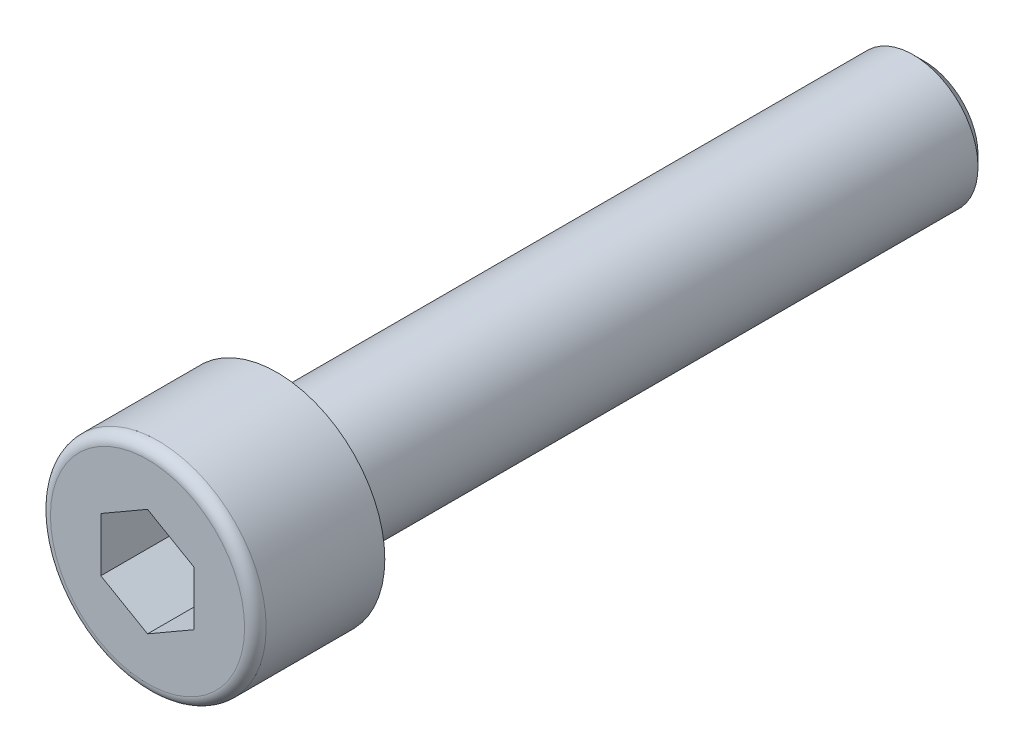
from build123d import *

# Parameters (mm, degrees)
ESQUISSE1_R             = 3
BASE_EXTRUSION_DEPTH    = 36
CHANFREIN1_SIZE         = 0.5
ESQUISSE2_R             = 5
BOSS_EXTRU_1_DEPTH      = 6
ENL_V_MAT_EXTRU_1_DEPTH = 3.5
CONG_2_R                = 0.5


with BuildPart() as part:
    # Esquisse1 → Base-Extrusion (new body)
    with BuildSketch(Plane.XY):
        Circle(ESQUISSE1_R)
    extrude(amount=BASE_EXTRUSION_DEPTH)

    # Chanfrein1
    chanfrein1_edges = [part.edges().sort_by_distance(p)[0] for p in [
        (-3, 0, 0),
    ]]
    chamfer(chanfrein1_edges, length=CHANFREIN1_SIZE)

    # Esquisse2 → Boss.-Extru.1 (add)
    with BuildSketch(Plane.XY.offset(30)):
        Circle(ESQUISSE2_R)
    extrude(amount=BOSS_EXTRU_1_DEPTH)

    # Esquisse3 → Enl_v. mat.-Extru.1 (cut)
    with BuildSketch(Plane.XY.offset(36)):
        Polygon((0, 2.5), (-2.165063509, 1.25), (-2.165063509, -1.25), (0, -2.5), (2.165063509, -1.25), (2.165063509, 1.25), align=None)
    extrude(amount=-ENL_V_MAT_EXTRU_1_DEPTH, mode=Mode.SUBTRACT)

    # Cong_2
    cong_2_edges = [part.edges().sort_by_distance(p)[0] for p in [
        (-5, 0, 36),
    ]]
    fillet(cong_2_edges, radius=CONG_2_R)


solid = part.part
